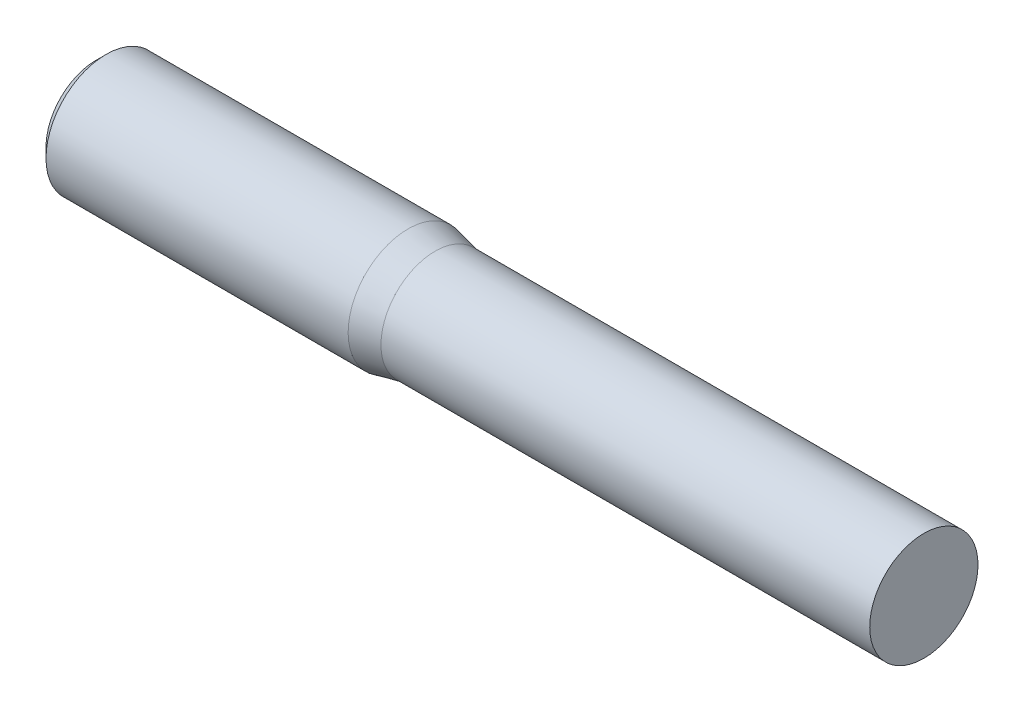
from build123d import *

# Parameters (mm, degrees)
HEADCHAMFER_SIZE = 0.812
BASEEND_START    = 4
SKETCH2_R        = 4.513
BASEEND_DEPTH    = 4


with BuildPart() as part:
    # Sketch1 → Base (revolve)
    with BuildSketch(Plane.XY, mode=Mode.PRIVATE) as base_sk:
        Polygon((0, 0), (0, 5), (26, 5), (28.25, 4.513), (65, 4.513), (65, 0), align=None)
    revolve(base_sk.sketch.rotate(Axis((0, 0, 0), (1, 0, 0)), 90), axis=Axis((0, 0, 0), (1, 0, 0)))

    # HeadChamfer
    headchamfer_edges = [part.edges().sort_by_distance(p)[0] for p in [
        (0, 0, -5),
    ]]
    chamfer(headchamfer_edges, length=HEADCHAMFER_SIZE)

    # Sketch2 → BaseEnd (add)
    with BuildSketch(Plane(origin=(65, 0, 0), x_dir=(0, 0, -1), z_dir=(1, 0, 0)).offset(BASEEND_START)):
        with Locations(Location((0, 0, 0), (0, 0, 180))):
            Circle(SKETCH2_R)
    extrude(amount=-BASEEND_DEPTH)


solid = part.part
